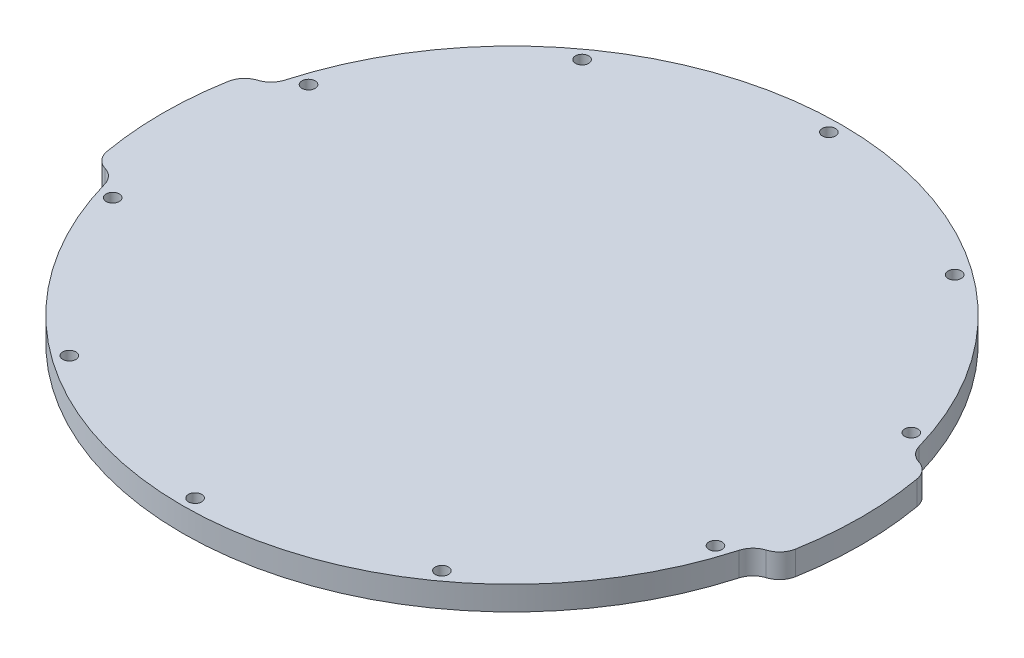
from build123d import *

# Parameters (mm, degrees)
SKETCH1_R           = 1.65
BOSS_EXTRUDE1_DEPTH = 6
FILLET1_R           = 5


with BuildPart() as part:
    # Sketch1 → Boss-Extrude1 (new body)
    with BuildSketch(Plane(origin=(0, 0, 0), x_dir=(1, 0, 0), z_dir=(0, 1, 0))):
        with BuildLine():
            ThreePointArc((-86.219918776, -15.202897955), (-87.55, 0), (-86.219918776, 15.202897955))
            ThreePointArc((-86.219918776, 15.202897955), (-84.101406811, 18.473379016), (-80.278914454, 19.23014285))
            ThreePointArc((-80.278914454, 19.23014285), (0, 82.55), (80.278914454, 19.23014285))
            ThreePointArc((80.278914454, 19.23014285), (84.101406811, 18.473379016), (86.219918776, 15.202897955))
            ThreePointArc((86.219918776, 15.202897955), (87.55, 0), (86.219918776, -15.202897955))
            ThreePointArc((86.219918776, -15.202897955), (84.101406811, -18.473379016), (80.278914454, -19.23014285))
            ThreePointArc((80.278914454, -19.23014285), (0, -82.55), (-80.278914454, -19.23014285))
            ThreePointArc((-80.278914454, -19.23014285), (-84.101406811, -18.473379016), (-86.219918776, -15.202897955))
        make_face()
        with Locations(Location((0, 79.35, 0), (0, 0, 270))):
            Circle(SKETCH1_R, mode=Mode.SUBTRACT)
        with Locations(Location((46.640759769, 64.195498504, 0), (0, 0, 270))):
            Circle(SKETCH1_R, mode=Mode.SUBTRACT)
        with Locations(Location((75.466334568, 24.520498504, 0), (0, 0, 270))):
            Circle(SKETCH1_R, mode=Mode.SUBTRACT)
        with Locations(Location((75.466334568, -24.520498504, 0), (0, 0, 270))):
            Circle(SKETCH1_R, mode=Mode.SUBTRACT)
        with Locations(Location((46.640759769, -64.195498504, 0), (0, 0, 270))):
            Circle(SKETCH1_R, mode=Mode.SUBTRACT)
        with Locations(Location((0, -79.35, 0), (0, 0, 270))):
            Circle(SKETCH1_R, mode=Mode.SUBTRACT)
        with Locations(Location((-46.640759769, -64.195498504, 0), (0, 0, 270))):
            Circle(SKETCH1_R, mode=Mode.SUBTRACT)
        with Locations(Location((-75.466334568, -24.520498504, 0), (0, 0, 270))):
            Circle(SKETCH1_R, mode=Mode.SUBTRACT)
        with Locations(Location((-75.466334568, 24.520498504, 0), (0, 0, 270))):
            Circle(SKETCH1_R, mode=Mode.SUBTRACT)
        with Locations(Location((-46.640759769, 64.195498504, 0), (0, 0, 270))):
            Circle(SKETCH1_R, mode=Mode.SUBTRACT)
    extrude(amount=BOSS_EXTRUDE1_DEPTH)

    # Fillet1
    fillet1_edges = [part.edges().sort_by_distance(p)[0] for p in [
        (-80.278914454, 3, -19.23014285),
        (80.278914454, 3, -19.23014285),
        (80.278914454, 3, 19.23014285),
        (-80.278914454, 3, 19.23014285),
    ]]
    fillet(fillet1_edges, radius=FILLET1_R)


solid = part.part
